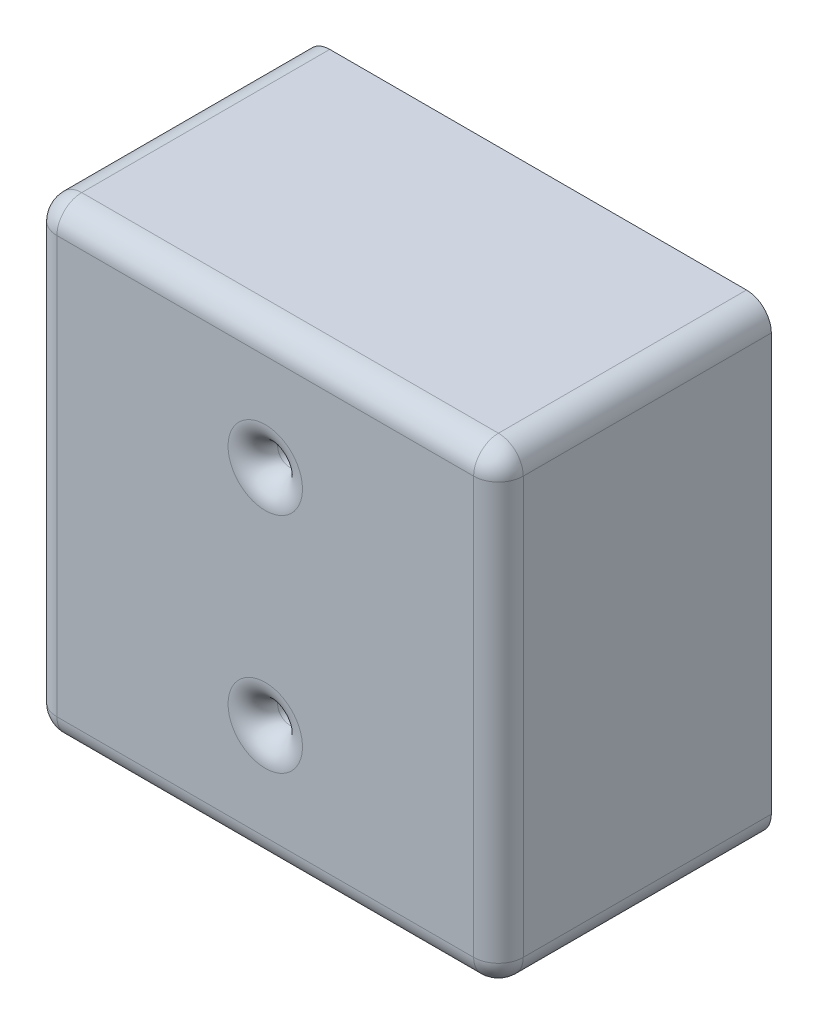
ISO-10303-21;
HEADER;
FILE_DESCRIPTION(('STEP AP214'),'2;1');
FILE_NAME('part.step','',(''),(''),'','','');
FILE_SCHEMA(('AUTOMOTIVE_DESIGN { 1 0 10303 214 1 1 1 1 }'));
ENDSEC;
DATA;
#1=APPLICATION_CONTEXT('core data for automotive mechanical design processes');
#2=APPLICATION_PROTOCOL_DEFINITION('international standard','automotive_design',2000,#1);
#3=PRODUCT_CONTEXT('',#1,'mechanical');
#4=PRODUCT('Part','Part','',(#3));
#5=PRODUCT_RELATED_PRODUCT_CATEGORY('part','',(#4));
#6=PRODUCT_DEFINITION_FORMATION('','',#4);
#7=PRODUCT_DEFINITION_CONTEXT('part definition',#1,'design');
#8=PRODUCT_DEFINITION('design','',#6,#7);
#9=PRODUCT_DEFINITION_SHAPE('','',#8);
#10=(LENGTH_UNIT() NAMED_UNIT(*) SI_UNIT(.MILLI.,.METRE.));
#11=(NAMED_UNIT(*) PLANE_ANGLE_UNIT() SI_UNIT($,.RADIAN.));
#12=(NAMED_UNIT(*) SI_UNIT($,.STERADIAN.) SOLID_ANGLE_UNIT());
#13=UNCERTAINTY_MEASURE_WITH_UNIT(LENGTH_MEASURE(1.E-05),#10,'distance_accuracy_value','');
#14=(GEOMETRIC_REPRESENTATION_CONTEXT(3) GLOBAL_UNCERTAINTY_ASSIGNED_CONTEXT((#13)) GLOBAL_UNIT_ASSIGNED_CONTEXT((#10,
#11,#12)) REPRESENTATION_CONTEXT('',''));
#15=CARTESIAN_POINT('',(0.,0.,0.));
#16=DIRECTION('',(0.,0.,1.));
#17=DIRECTION('',(1.,0.,0.));
#18=AXIS2_PLACEMENT_3D('',#15,#16,#17);
#19=CARTESIAN_POINT('',(-42.,42.,55.));
#20=DIRECTION('',(0.,0.,-1.));
#21=DIRECTION('',(-1.,0.,0.));
#22=AXIS2_PLACEMENT_3D('',#19,#20,#21);
#23=CYLINDRICAL_SURFACE('',#22,5.);
#24=DIRECTION('',(0.,0.,-1.));
#25=VECTOR('',#24,1.);
#26=CARTESIAN_POINT('',(-47.,42.,55.));
#27=LINE('',#26,#25);
#28=CARTESIAN_POINT('',(-47.,42.,50.));
#29=VERTEX_POINT('',#28);
#30=CARTESIAN_POINT('',(-47.,42.,0.));
#31=VERTEX_POINT('',#30);
#32=EDGE_CURVE('E105',#29,#31,#27,.T.);
#33=ORIENTED_EDGE('',*,*,#32,.F.);
#34=CARTESIAN_POINT('',(-42.,42.,50.));
#35=DIRECTION('',(0.,0.,-1.));
#36=DIRECTION('',(-1.,0.,0.));
#37=AXIS2_PLACEMENT_3D('',#34,#35,#36);
#38=CIRCLE('',#37,5.);
#39=CARTESIAN_POINT('',(-42.,47.,50.));
#40=VERTEX_POINT('',#39);
#41=EDGE_CURVE('E189',#29,#40,#38,.T.);
#42=ORIENTED_EDGE('',*,*,#41,.T.);
#43=DIRECTION('',(0.,0.,-1.));
#44=VECTOR('',#43,1.);
#45=CARTESIAN_POINT('',(-42.,47.,55.));
#46=LINE('',#45,#44);
#47=CARTESIAN_POINT('',(-42.,47.,0.));
#48=VERTEX_POINT('',#47);
#49=EDGE_CURVE('E126',#40,#48,#46,.T.);
#50=ORIENTED_EDGE('',*,*,#49,.T.);
#51=CARTESIAN_POINT('',(-42.,42.,0.));
#52=DIRECTION('',(0.,0.,1.));
#53=DIRECTION('',(-1.,0.,0.));
#54=AXIS2_PLACEMENT_3D('',#51,#52,#53);
#55=CIRCLE('',#54,5.);
#56=EDGE_CURVE('E120',#48,#31,#55,.T.);
#57=ORIENTED_EDGE('',*,*,#56,.T.);
#58=EDGE_LOOP('',(#33,#42,#50,#57));
#59=FACE_BOUND('',#58,.T.);
#60=ADVANCED_FACE('F30',(#59),#23,.T.);
#61=CARTESIAN_POINT('',(-47.,42.,55.));
#62=DIRECTION('',(1.,0.,0.));
#63=DIRECTION('',(0.,1.,0.));
#64=AXIS2_PLACEMENT_3D('',#61,#62,#63);
#65=PLANE('',#64);
#66=DIRECTION('',(0.,0.,-1.));
#67=VECTOR('',#66,1.);
#68=CARTESIAN_POINT('',(-47.,-42.,55.));
#69=LINE('',#68,#67);
#70=CARTESIAN_POINT('',(-47.,-42.,50.));
#71=VERTEX_POINT('',#70);
#72=CARTESIAN_POINT('',(-47.,-42.,0.));
#73=VERTEX_POINT('',#72);
#74=EDGE_CURVE('E114',#71,#73,#69,.T.);
#75=ORIENTED_EDGE('',*,*,#74,.F.);
#76=DIRECTION('',(0.,-1.,0.));
#77=VECTOR('',#76,1.);
#78=CARTESIAN_POINT('',(-47.,42.,50.));
#79=LINE('',#78,#77);
#80=EDGE_CURVE('E44',#71,#29,#79,.F.);
#81=ORIENTED_EDGE('',*,*,#80,.T.);
#82=ORIENTED_EDGE('',*,*,#32,.T.);
#83=DIRECTION('',(0.,-1.,0.));
#84=VECTOR('',#83,1.);
#85=CARTESIAN_POINT('',(-47.,42.,0.));
#86=LINE('',#85,#84);
#87=EDGE_CURVE('E108',#31,#73,#86,.T.);
#88=ORIENTED_EDGE('',*,*,#87,.T.);
#89=EDGE_LOOP('',(#75,#81,#82,#88));
#90=FACE_BOUND('',#89,.T.);
#91=ADVANCED_FACE('F107',(#90),#65,.F.);
#92=CARTESIAN_POINT('',(-42.,-42.,55.));
#93=DIRECTION('',(0.,0.,-1.));
#94=DIRECTION('',(-1.,0.,0.));
#95=AXIS2_PLACEMENT_3D('',#92,#93,#94);
#96=CYLINDRICAL_SURFACE('',#95,5.);
#97=DIRECTION('',(0.,0.,-1.));
#98=VECTOR('',#97,1.);
#99=CARTESIAN_POINT('',(-42.,-47.,55.));
#100=LINE('',#99,#98);
#101=CARTESIAN_POINT('',(-42.,-47.,50.));
#102=VERTEX_POINT('',#101);
#103=CARTESIAN_POINT('',(-42.,-47.,0.));
#104=VERTEX_POINT('',#103);
#105=EDGE_CURVE('E159',#102,#104,#100,.T.);
#106=ORIENTED_EDGE('',*,*,#105,.F.);
#107=CARTESIAN_POINT('',(-42.,-42.,50.));
#108=DIRECTION('',(0.,0.,-1.));
#109=DIRECTION('',(-1.,0.,0.));
#110=AXIS2_PLACEMENT_3D('',#107,#108,#109);
#111=CIRCLE('',#110,5.);
#112=EDGE_CURVE('E52',#102,#71,#111,.T.);
#113=ORIENTED_EDGE('',*,*,#112,.T.);
#114=ORIENTED_EDGE('',*,*,#74,.T.);
#115=CARTESIAN_POINT('',(-42.,-42.,0.));
#116=DIRECTION('',(0.,0.,1.));
#117=DIRECTION('',(1.,0.,0.));
#118=AXIS2_PLACEMENT_3D('',#115,#116,#117);
#119=CIRCLE('',#118,5.);
#120=EDGE_CURVE('E123',#73,#104,#119,.T.);
#121=ORIENTED_EDGE('',*,*,#120,.T.);
#122=EDGE_LOOP('',(#106,#113,#114,#121));
#123=FACE_BOUND('',#122,.T.);
#124=ADVANCED_FACE('F216',(#123),#96,.T.);
#125=CARTESIAN_POINT('',(-42.,-47.,55.));
#126=DIRECTION('',(0.,1.,0.));
#127=DIRECTION('',(-1.,0.,0.));
#128=AXIS2_PLACEMENT_3D('',#125,#126,#127);
#129=PLANE('',#128);
#130=DIRECTION('',(0.,0.,-1.));
#131=VECTOR('',#130,1.);
#132=CARTESIAN_POINT('',(42.,-47.,55.));
#133=LINE('',#132,#131);
#134=CARTESIAN_POINT('',(42.,-47.,50.));
#135=VERTEX_POINT('',#134);
#136=CARTESIAN_POINT('',(42.,-47.,0.));
#137=VERTEX_POINT('',#136);
#138=EDGE_CURVE('E157',#135,#137,#133,.T.);
#139=ORIENTED_EDGE('',*,*,#138,.F.);
#140=DIRECTION('',(1.,0.,0.));
#141=VECTOR('',#140,1.);
#142=CARTESIAN_POINT('',(-42.,-47.,50.));
#143=LINE('',#142,#141);
#144=EDGE_CURVE('E185',#135,#102,#143,.F.);
#145=ORIENTED_EDGE('',*,*,#144,.T.);
#146=ORIENTED_EDGE('',*,*,#105,.T.);
#147=DIRECTION('',(1.,0.,0.));
#148=VECTOR('',#147,1.);
#149=CARTESIAN_POINT('',(-42.,-47.,0.));
#150=LINE('',#149,#148);
#151=EDGE_CURVE('E136',#104,#137,#150,.T.);
#152=ORIENTED_EDGE('',*,*,#151,.T.);
#153=EDGE_LOOP('',(#139,#145,#146,#152));
#154=FACE_BOUND('',#153,.T.);
#155=ADVANCED_FACE('F220',(#154),#129,.F.);
#156=CARTESIAN_POINT('',(42.,-42.,55.));
#157=DIRECTION('',(0.,0.,-1.));
#158=DIRECTION('',(-1.,0.,0.));
#159=AXIS2_PLACEMENT_3D('',#156,#157,#158);
#160=CYLINDRICAL_SURFACE('',#159,4.99999999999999);
#161=DIRECTION('',(0.,0.,-1.));
#162=VECTOR('',#161,1.);
#163=CARTESIAN_POINT('',(47.,-42.,55.));
#164=LINE('',#163,#162);
#165=CARTESIAN_POINT('',(47.,-42.,50.));
#166=VERTEX_POINT('',#165);
#167=CARTESIAN_POINT('',(47.,-42.,0.));
#168=VERTEX_POINT('',#167);
#169=EDGE_CURVE('E155',#166,#168,#164,.T.);
#170=ORIENTED_EDGE('',*,*,#169,.F.);
#171=CARTESIAN_POINT('',(42.,-42.,50.));
#172=DIRECTION('',(0.,0.,-1.));
#173=DIRECTION('',(-1.,0.,0.));
#174=AXIS2_PLACEMENT_3D('',#171,#172,#173);
#175=CIRCLE('',#174,4.99999999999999);
#176=EDGE_CURVE('E183',#166,#135,#175,.T.);
#177=ORIENTED_EDGE('',*,*,#176,.T.);
#178=ORIENTED_EDGE('',*,*,#138,.T.);
#179=CARTESIAN_POINT('',(42.,-42.,0.));
#180=DIRECTION('',(0.,0.,1.));
#181=DIRECTION('',(1.,0.,0.));
#182=AXIS2_PLACEMENT_3D('',#179,#180,#181);
#183=CIRCLE('',#182,4.99999999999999);
#184=EDGE_CURVE('E139',#137,#168,#183,.T.);
#185=ORIENTED_EDGE('',*,*,#184,.T.);
#186=EDGE_LOOP('',(#170,#177,#178,#185));
#187=FACE_BOUND('',#186,.T.);
#188=ADVANCED_FACE('F225',(#187),#160,.T.);
#189=CARTESIAN_POINT('',(47.,42.,55.));
#190=DIRECTION('',(-1.,0.,0.));
#191=DIRECTION('',(0.,-1.,0.));
#192=AXIS2_PLACEMENT_3D('',#189,#190,#191);
#193=PLANE('',#192);
#194=DIRECTION('',(0.,0.,-1.));
#195=VECTOR('',#194,1.);
#196=CARTESIAN_POINT('',(47.,42.,55.));
#197=LINE('',#196,#195);
#198=CARTESIAN_POINT('',(47.,42.,50.));
#199=VERTEX_POINT('',#198);
#200=CARTESIAN_POINT('',(47.,42.,0.));
#201=VERTEX_POINT('',#200);
#202=EDGE_CURVE('E153',#199,#201,#197,.T.);
#203=ORIENTED_EDGE('',*,*,#202,.F.);
#204=DIRECTION('',(0.,1.,0.));
#205=VECTOR('',#204,1.);
#206=CARTESIAN_POINT('',(47.,42.,50.));
#207=LINE('',#206,#205);
#208=EDGE_CURVE('E181',#199,#166,#207,.F.);
#209=ORIENTED_EDGE('',*,*,#208,.T.);
#210=ORIENTED_EDGE('',*,*,#169,.T.);
#211=DIRECTION('',(0.,1.,0.));
#212=VECTOR('',#211,1.);
#213=CARTESIAN_POINT('',(47.,42.,0.));
#214=LINE('',#213,#212);
#215=EDGE_CURVE('E142',#168,#201,#214,.T.);
#216=ORIENTED_EDGE('',*,*,#215,.T.);
#217=EDGE_LOOP('',(#203,#209,#210,#216));
#218=FACE_BOUND('',#217,.T.);
#219=ADVANCED_FACE('F229',(#218),#193,.F.);
#220=CARTESIAN_POINT('',(42.,42.,55.));
#221=DIRECTION('',(0.,0.,-1.));
#222=DIRECTION('',(-1.,0.,0.));
#223=AXIS2_PLACEMENT_3D('',#220,#221,#222);
#224=CYLINDRICAL_SURFACE('',#223,4.99999999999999);
#225=DIRECTION('',(0.,0.,-1.));
#226=VECTOR('',#225,1.);
#227=CARTESIAN_POINT('',(42.,47.,55.));
#228=LINE('',#227,#226);
#229=CARTESIAN_POINT('',(42.,47.,50.));
#230=VERTEX_POINT('',#229);
#231=CARTESIAN_POINT('',(42.,47.,0.));
#232=VERTEX_POINT('',#231);
#233=EDGE_CURVE('E151',#230,#232,#228,.T.);
#234=ORIENTED_EDGE('',*,*,#233,.F.);
#235=CARTESIAN_POINT('',(42.,42.,50.));
#236=DIRECTION('',(0.,0.,-1.));
#237=DIRECTION('',(-1.,0.,0.));
#238=AXIS2_PLACEMENT_3D('',#235,#236,#237);
#239=CIRCLE('',#238,4.99999999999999);
#240=EDGE_CURVE('E179',#230,#199,#239,.T.);
#241=ORIENTED_EDGE('',*,*,#240,.T.);
#242=ORIENTED_EDGE('',*,*,#202,.T.);
#243=CARTESIAN_POINT('',(42.,42.,0.));
#244=DIRECTION('',(0.,0.,1.));
#245=DIRECTION('',(1.,0.,0.));
#246=AXIS2_PLACEMENT_3D('',#243,#244,#245);
#247=CIRCLE('',#246,4.99999999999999);
#248=EDGE_CURVE('E145',#201,#232,#247,.T.);
#249=ORIENTED_EDGE('',*,*,#248,.T.);
#250=EDGE_LOOP('',(#234,#241,#242,#249));
#251=FACE_BOUND('',#250,.T.);
#252=ADVANCED_FACE('F233',(#251),#224,.T.);
#253=CARTESIAN_POINT('',(-42.,47.,55.));
#254=DIRECTION('',(0.,-1.,0.));
#255=DIRECTION('',(1.,0.,0.));
#256=AXIS2_PLACEMENT_3D('',#253,#254,#255);
#257=PLANE('',#256);
#258=ORIENTED_EDGE('',*,*,#49,.F.);
#259=DIRECTION('',(-1.,0.,0.));
#260=VECTOR('',#259,1.);
#261=CARTESIAN_POINT('',(-42.,47.,50.));
#262=LINE('',#261,#260);
#263=EDGE_CURVE('E176',#40,#230,#262,.F.);
#264=ORIENTED_EDGE('',*,*,#263,.T.);
#265=ORIENTED_EDGE('',*,*,#233,.T.);
#266=DIRECTION('',(-1.,0.,0.));
#267=VECTOR('',#266,1.);
#268=CARTESIAN_POINT('',(-42.,47.,0.));
#269=LINE('',#268,#267);
#270=EDGE_CURVE('E148',#232,#48,#269,.T.);
#271=ORIENTED_EDGE('',*,*,#270,.T.);
#272=EDGE_LOOP('',(#258,#264,#265,#271));
#273=FACE_BOUND('',#272,.T.);
#274=ADVANCED_FACE('F237',(#273),#257,.F.);
#275=CARTESIAN_POINT('',(-42.,42.,55.));
#276=DIRECTION('',(0.,0.,-1.));
#277=DIRECTION('',(-1.,0.,0.));
#278=AXIS2_PLACEMENT_3D('',#275,#276,#277);
#279=PLANE('',#278);
#280=DIRECTION('',(0.,1.,0.));
#281=VECTOR('',#280,1.);
#282=CARTESIAN_POINT('',(42.,42.,55.));
#283=LINE('',#282,#281);
#284=CARTESIAN_POINT('',(42.,-42.,55.));
#285=VERTEX_POINT('',#284);
#286=CARTESIAN_POINT('',(42.,42.,55.));
#287=VERTEX_POINT('',#286);
#288=EDGE_CURVE('E171',#285,#287,#283,.T.);
#289=ORIENTED_EDGE('',*,*,#288,.T.);
#290=DIRECTION('',(-1.,0.,0.));
#291=VECTOR('',#290,1.);
#292=CARTESIAN_POINT('',(-42.,42.,55.));
#293=LINE('',#292,#291);
#294=CARTESIAN_POINT('',(-42.,42.,55.));
#295=VERTEX_POINT('',#294);
#296=EDGE_CURVE('E173',#287,#295,#293,.T.);
#297=ORIENTED_EDGE('',*,*,#296,.T.);
#298=DIRECTION('',(0.,-1.,0.));
#299=VECTOR('',#298,1.);
#300=CARTESIAN_POINT('',(-42.,42.,55.));
#301=LINE('',#300,#299);
#302=CARTESIAN_POINT('',(-42.,-42.,55.));
#303=VERTEX_POINT('',#302);
#304=EDGE_CURVE('E167',#295,#303,#301,.T.);
#305=ORIENTED_EDGE('',*,*,#304,.T.);
#306=DIRECTION('',(1.,0.,0.));
#307=VECTOR('',#306,1.);
#308=CARTESIAN_POINT('',(-42.,-42.,55.));
#309=LINE('',#308,#307);
#310=EDGE_CURVE('E169',#303,#285,#309,.T.);
#311=ORIENTED_EDGE('',*,*,#310,.T.);
#312=EDGE_LOOP('',(#289,#297,#305,#311));
#313=FACE_BOUND('',#312,.T.);
#314=CARTESIAN_POINT('',(0.,22.5,55.));
#315=DIRECTION('',(0.,0.,-1.));
#316=DIRECTION('',(-1.,0.,0.));
#317=AXIS2_PLACEMENT_3D('',#314,#315,#316);
#318=CIRCLE('',#317,7.5);
#319=CARTESIAN_POINT('',(-7.5,22.5,55.));
#320=VERTEX_POINT('',#319);
#321=EDGE_CURVE('E164',#320,#320,#318,.T.);
#322=ORIENTED_EDGE('',*,*,#321,.T.);
#323=EDGE_LOOP('',(#322));
#324=FACE_BOUND('',#323,.T.);
#325=CARTESIAN_POINT('',(0.,-22.5,55.));
#326=DIRECTION('',(0.,0.,-1.));
#327=DIRECTION('',(-1.,0.,0.));
#328=AXIS2_PLACEMENT_3D('',#325,#326,#327);
#329=CIRCLE('',#328,7.5);
#330=CARTESIAN_POINT('',(-7.5,-22.5,55.));
#331=VERTEX_POINT('',#330);
#332=EDGE_CURVE('E113',#331,#331,#329,.T.);
#333=ORIENTED_EDGE('',*,*,#332,.T.);
#334=EDGE_LOOP('',(#333));
#335=FACE_BOUND('',#334,.T.);
#336=ADVANCED_FACE('F241',(#313,#324,#335),#279,.F.);
#337=CARTESIAN_POINT('',(-42.,42.,0.));
#338=DIRECTION('',(0.,0.,-1.));
#339=DIRECTION('',(-1.,0.,0.));
#340=AXIS2_PLACEMENT_3D('',#337,#338,#339);
#341=PLANE('',#340);
#342=CARTESIAN_POINT('',(0.,-25.,0.));
#343=DIRECTION('',(0.,0.,-1.));
#344=DIRECTION('',(-1.,0.,0.));
#345=AXIS2_PLACEMENT_3D('',#342,#343,#344);
#346=CIRCLE('',#345,3.);
#347=CARTESIAN_POINT('',(-3.,-25.,0.));
#348=VERTEX_POINT('',#347);
#349=EDGE_CURVE('E351',#348,#348,#346,.T.);
#350=ORIENTED_EDGE('',*,*,#349,.F.);
#351=EDGE_LOOP('',(#350));
#352=FACE_BOUND('',#351,.T.);
#353=CARTESIAN_POINT('',(0.,25.,0.));
#354=DIRECTION('',(0.,0.,-1.));
#355=DIRECTION('',(-1.,0.,0.));
#356=AXIS2_PLACEMENT_3D('',#353,#354,#355);
#357=CIRCLE('',#356,3.);
#358=CARTESIAN_POINT('',(-3.,25.,0.));
#359=VERTEX_POINT('',#358);
#360=EDGE_CURVE('E131',#359,#359,#357,.T.);
#361=ORIENTED_EDGE('',*,*,#360,.F.);
#362=EDGE_LOOP('',(#361));
#363=FACE_BOUND('',#362,.T.);
#364=ORIENTED_EDGE('',*,*,#56,.F.);
#365=ORIENTED_EDGE('',*,*,#270,.F.);
#366=ORIENTED_EDGE('',*,*,#248,.F.);
#367=ORIENTED_EDGE('',*,*,#215,.F.);
#368=ORIENTED_EDGE('',*,*,#184,.F.);
#369=ORIENTED_EDGE('',*,*,#151,.F.);
#370=ORIENTED_EDGE('',*,*,#120,.F.);
#371=ORIENTED_EDGE('',*,*,#87,.F.);
#372=EDGE_LOOP('',(#364,#365,#366,#367,#368,#369,#370,#371));
#373=FACE_BOUND('',#372,.T.);
#374=ADVANCED_FACE('F118',(#352,#363,#373),#341,.T.);
#375=CARTESIAN_POINT('',(0.,25.,20.));
#376=DIRECTION('',(0.,0.,-1.));
#377=DIRECTION('',(-1.,0.,0.));
#378=AXIS2_PLACEMENT_3D('',#375,#376,#377);
#379=CYLINDRICAL_SURFACE('',#378,3.);
#380=CARTESIAN_POINT('',(0.,25.,20.));
#381=DIRECTION('',(0.,0.,-1.));
#382=DIRECTION('',(-1.,0.,0.));
#383=AXIS2_PLACEMENT_3D('',#380,#381,#382);
#384=CIRCLE('',#383,3.);
#385=CARTESIAN_POINT('',(-3.,25.,20.));
#386=VERTEX_POINT('',#385);
#387=EDGE_CURVE('E128',#386,#386,#384,.T.);
#388=ORIENTED_EDGE('',*,*,#387,.F.);
#389=EDGE_LOOP('',(#388));
#390=FACE_BOUND('',#389,.T.);
#391=ORIENTED_EDGE('',*,*,#360,.T.);
#392=EDGE_LOOP('',(#391));
#393=FACE_BOUND('',#392,.T.);
#394=ADVANCED_FACE('F248',(#390,#393),#379,.F.);
#395=CARTESIAN_POINT('',(0.,25.,20.));
#396=DIRECTION('',(0.,0.,-1.));
#397=DIRECTION('',(-1.,0.,0.));
#398=AXIS2_PLACEMENT_3D('',#395,#396,#397);
#399=PLANE('',#398);
#400=ORIENTED_EDGE('',*,*,#387,.T.);
#401=EDGE_LOOP('',(#400));
#402=FACE_BOUND('',#401,.T.);
#403=ADVANCED_FACE('F252',(#402),#399,.T.);
#404=CARTESIAN_POINT('',(0.,-25.,20.));
#405=DIRECTION('',(0.,0.,-1.));
#406=DIRECTION('',(-1.,0.,0.));
#407=AXIS2_PLACEMENT_3D('',#404,#405,#406);
#408=CYLINDRICAL_SURFACE('',#407,3.);
#409=CARTESIAN_POINT('',(0.,-25.,20.));
#410=DIRECTION('',(0.,0.,-1.));
#411=DIRECTION('',(-1.,0.,0.));
#412=AXIS2_PLACEMENT_3D('',#409,#410,#411);
#413=CIRCLE('',#412,3.);
#414=CARTESIAN_POINT('',(-3.,-25.,20.));
#415=VERTEX_POINT('',#414);
#416=EDGE_CURVE('E354',#415,#415,#413,.T.);
#417=ORIENTED_EDGE('',*,*,#416,.F.);
#418=EDGE_LOOP('',(#417));
#419=FACE_BOUND('',#418,.T.);
#420=ORIENTED_EDGE('',*,*,#349,.T.);
#421=EDGE_LOOP('',(#420));
#422=FACE_BOUND('',#421,.T.);
#423=ADVANCED_FACE('F256',(#419,#422),#408,.F.);
#424=CARTESIAN_POINT('',(0.,-25.,20.));
#425=DIRECTION('',(0.,0.,-1.));
#426=DIRECTION('',(-1.,0.,0.));
#427=AXIS2_PLACEMENT_3D('',#424,#425,#426);
#428=PLANE('',#427);
#429=ORIENTED_EDGE('',*,*,#416,.T.);
#430=EDGE_LOOP('',(#429));
#431=FACE_BOUND('',#430,.T.);
#432=ADVANCED_FACE('F260',(#431),#428,.T.);
#433=CARTESIAN_POINT('',(0.,22.5,35.));
#434=DIRECTION('',(0.,0.,1.));
#435=DIRECTION('',(1.,0.,0.));
#436=AXIS2_PLACEMENT_3D('',#433,#434,#435);
#437=CYLINDRICAL_SURFACE('',#436,2.5);
#438=CARTESIAN_POINT('',(0.,22.5,50.));
#439=DIRECTION('',(0.,0.,-1.));
#440=DIRECTION('',(-1.,0.,0.));
#441=AXIS2_PLACEMENT_3D('',#438,#439,#440);
#442=CIRCLE('',#441,2.5);
#443=CARTESIAN_POINT('',(-2.5,22.5,50.));
#444=VERTEX_POINT('',#443);
#445=EDGE_CURVE('E37',#444,#444,#442,.F.);
#446=ORIENTED_EDGE('',*,*,#445,.T.);
#447=EDGE_LOOP('',(#446));
#448=FACE_BOUND('',#447,.T.);
#449=CARTESIAN_POINT('',(0.,22.5,35.));
#450=DIRECTION('',(0.,0.,1.));
#451=DIRECTION('',(1.,0.,0.));
#452=AXIS2_PLACEMENT_3D('',#449,#450,#451);
#453=CIRCLE('',#452,2.5);
#454=CARTESIAN_POINT('',(2.5,22.5,35.));
#455=VERTEX_POINT('',#454);
#456=EDGE_CURVE('E348',#455,#455,#453,.T.);
#457=ORIENTED_EDGE('',*,*,#456,.F.);
#458=EDGE_LOOP('',(#457));
#459=FACE_BOUND('',#458,.T.);
#460=ADVANCED_FACE('F193',(#448,#459),#437,.F.);
#461=CARTESIAN_POINT('',(0.,22.5,35.));
#462=DIRECTION('',(0.,0.,1.));
#463=DIRECTION('',(1.,0.,0.));
#464=AXIS2_PLACEMENT_3D('',#461,#462,#463);
#465=PLANE('',#464);
#466=ORIENTED_EDGE('',*,*,#456,.T.);
#467=EDGE_LOOP('',(#466));
#468=FACE_BOUND('',#467,.T.);
#469=ADVANCED_FACE('F267',(#468),#465,.T.);
#470=CARTESIAN_POINT('',(0.,-22.5,35.));
#471=DIRECTION('',(0.,0.,1.));
#472=DIRECTION('',(1.,0.,0.));
#473=AXIS2_PLACEMENT_3D('',#470,#471,#472);
#474=CYLINDRICAL_SURFACE('',#473,2.5);
#475=CARTESIAN_POINT('',(0.,-22.5,50.));
#476=DIRECTION('',(0.,0.,-1.));
#477=DIRECTION('',(-1.,0.,0.));
#478=AXIS2_PLACEMENT_3D('',#475,#476,#477);
#479=CIRCLE('',#478,2.5);
#480=CARTESIAN_POINT('',(-2.5,-22.5,50.));
#481=VERTEX_POINT('',#480);
#482=EDGE_CURVE('E11',#481,#481,#479,.F.);
#483=ORIENTED_EDGE('',*,*,#482,.T.);
#484=EDGE_LOOP('',(#483));
#485=FACE_BOUND('',#484,.T.);
#486=CARTESIAN_POINT('',(0.,-22.5,35.));
#487=DIRECTION('',(0.,0.,1.));
#488=DIRECTION('',(1.,0.,0.));
#489=AXIS2_PLACEMENT_3D('',#486,#487,#488);
#490=CIRCLE('',#489,2.5);
#491=CARTESIAN_POINT('',(2.5,-22.5,35.));
#492=VERTEX_POINT('',#491);
#493=EDGE_CURVE('E345',#492,#492,#490,.T.);
#494=ORIENTED_EDGE('',*,*,#493,.F.);
#495=EDGE_LOOP('',(#494));
#496=FACE_BOUND('',#495,.T.);
#497=ADVANCED_FACE('F270',(#485,#496),#474,.F.);
#498=CARTESIAN_POINT('',(0.,-22.5,35.));
#499=DIRECTION('',(0.,0.,1.));
#500=DIRECTION('',(1.,0.,0.));
#501=AXIS2_PLACEMENT_3D('',#498,#499,#500);
#502=PLANE('',#501);
#503=ORIENTED_EDGE('',*,*,#493,.T.);
#504=EDGE_LOOP('',(#503));
#505=FACE_BOUND('',#504,.T.);
#506=ADVANCED_FACE('F274',(#505),#502,.T.);
#507=CARTESIAN_POINT('',(-42.,-42.,50.));
#508=DIRECTION('',(1.,0.,0.));
#509=DIRECTION('',(0.,1.,0.));
#510=AXIS2_PLACEMENT_3D('',#507,#508,#509);
#511=CYLINDRICAL_SURFACE('',#510,5.);
#512=CARTESIAN_POINT('',(-42.,-42.,50.));
#513=DIRECTION('',(-1.,0.,0.));
#514=DIRECTION('',(0.,0.,1.));
#515=AXIS2_PLACEMENT_3D('',#512,#513,#514);
#516=CIRCLE('',#515,5.);
#517=EDGE_CURVE('E334',#102,#303,#516,.T.);
#518=ORIENTED_EDGE('',*,*,#517,.F.);
#519=ORIENTED_EDGE('',*,*,#144,.F.);
#520=CARTESIAN_POINT('',(42.,-42.,50.));
#521=DIRECTION('',(1.,0.,0.));
#522=DIRECTION('',(0.,0.,-1.));
#523=AXIS2_PLACEMENT_3D('',#520,#521,#522);
#524=CIRCLE('',#523,5.);
#525=EDGE_CURVE('E338',#285,#135,#524,.T.);
#526=ORIENTED_EDGE('',*,*,#525,.F.);
#527=ORIENTED_EDGE('',*,*,#310,.F.);
#528=EDGE_LOOP('',(#518,#519,#526,#527));
#529=FACE_BOUND('',#528,.T.);
#530=ADVANCED_FACE('F278',(#529),#511,.T.);
#531=CARTESIAN_POINT('',(42.,-42.,50.));
#532=DIRECTION('',(0.,0.,1.));
#533=DIRECTION('',(1.,0.,0.));
#534=AXIS2_PLACEMENT_3D('',#531,#532,#533);
#535=SPHERICAL_SURFACE('',#534,5.);
#536=ORIENTED_EDGE('',*,*,#525,.T.);
#537=ORIENTED_EDGE('',*,*,#176,.F.);
#538=CARTESIAN_POINT('',(42.,-42.,50.));
#539=DIRECTION('',(0.,1.,0.));
#540=DIRECTION('',(0.,0.,1.));
#541=AXIS2_PLACEMENT_3D('',#538,#539,#540);
#542=CIRCLE('',#541,5.);
#543=EDGE_CURVE('E331',#285,#166,#542,.T.);
#544=ORIENTED_EDGE('',*,*,#543,.F.);
#545=EDGE_LOOP('',(#536,#537,#544));
#546=FACE_BOUND('',#545,.T.);
#547=ADVANCED_FACE('F282',(#546),#535,.T.);
#548=CARTESIAN_POINT('',(-42.,-42.,50.));
#549=DIRECTION('',(0.,0.,1.));
#550=DIRECTION('',(1.,0.,0.));
#551=AXIS2_PLACEMENT_3D('',#548,#549,#550);
#552=SPHERICAL_SURFACE('',#551,5.);
#553=ORIENTED_EDGE('',*,*,#112,.F.);
#554=ORIENTED_EDGE('',*,*,#517,.T.);
#555=CARTESIAN_POINT('',(-42.,-42.,50.));
#556=DIRECTION('',(0.,1.,0.));
#557=DIRECTION('',(0.,0.,1.));
#558=AXIS2_PLACEMENT_3D('',#555,#556,#557);
#559=CIRCLE('',#558,5.);
#560=EDGE_CURVE('E335',#71,#303,#559,.T.);
#561=ORIENTED_EDGE('',*,*,#560,.F.);
#562=EDGE_LOOP('',(#553,#554,#561));
#563=FACE_BOUND('',#562,.T.);
#564=ADVANCED_FACE('F286',(#563),#552,.T.);
#565=CARTESIAN_POINT('',(42.,42.,50.));
#566=DIRECTION('',(0.,1.,0.));
#567=DIRECTION('',(-1.,0.,0.));
#568=AXIS2_PLACEMENT_3D('',#565,#566,#567);
#569=CYLINDRICAL_SURFACE('',#568,5.);
#570=ORIENTED_EDGE('',*,*,#543,.T.);
#571=ORIENTED_EDGE('',*,*,#208,.F.);
#572=CARTESIAN_POINT('',(42.,42.,50.));
#573=DIRECTION('',(0.,1.,0.));
#574=DIRECTION('',(0.,0.,1.));
#575=AXIS2_PLACEMENT_3D('',#572,#573,#574);
#576=CIRCLE('',#575,5.);
#577=EDGE_CURVE('E322',#287,#199,#576,.T.);
#578=ORIENTED_EDGE('',*,*,#577,.F.);
#579=ORIENTED_EDGE('',*,*,#288,.F.);
#580=EDGE_LOOP('',(#570,#571,#578,#579));
#581=FACE_BOUND('',#580,.T.);
#582=ADVANCED_FACE('F290',(#581),#569,.T.);
#583=CARTESIAN_POINT('',(-42.,42.,50.));
#584=DIRECTION('',(0.,-1.,0.));
#585=DIRECTION('',(1.,0.,0.));
#586=AXIS2_PLACEMENT_3D('',#583,#584,#585);
#587=CYLINDRICAL_SURFACE('',#586,5.);
#588=ORIENTED_EDGE('',*,*,#560,.T.);
#589=ORIENTED_EDGE('',*,*,#304,.F.);
#590=CARTESIAN_POINT('',(-42.,42.,50.));
#591=DIRECTION('',(0.,1.,0.));
#592=DIRECTION('',(0.,0.,1.));
#593=AXIS2_PLACEMENT_3D('',#590,#591,#592);
#594=CIRCLE('',#593,5.);
#595=EDGE_CURVE('E310',#29,#295,#594,.T.);
#596=ORIENTED_EDGE('',*,*,#595,.F.);
#597=ORIENTED_EDGE('',*,*,#80,.F.);
#598=EDGE_LOOP('',(#588,#589,#596,#597));
#599=FACE_BOUND('',#598,.T.);
#600=ADVANCED_FACE('F294',(#599),#587,.T.);
#601=CARTESIAN_POINT('',(42.,42.,50.));
#602=DIRECTION('',(0.,0.,1.));
#603=DIRECTION('',(1.,0.,0.));
#604=AXIS2_PLACEMENT_3D('',#601,#602,#603);
#605=SPHERICAL_SURFACE('',#604,5.);
#606=ORIENTED_EDGE('',*,*,#577,.T.);
#607=ORIENTED_EDGE('',*,*,#240,.F.);
#608=CARTESIAN_POINT('',(42.,42.,50.));
#609=DIRECTION('',(-1.,0.,0.));
#610=DIRECTION('',(0.,0.,1.));
#611=AXIS2_PLACEMENT_3D('',#608,#609,#610);
#612=CIRCLE('',#611,5.);
#613=EDGE_CURVE('E317',#287,#230,#612,.T.);
#614=ORIENTED_EDGE('',*,*,#613,.F.);
#615=EDGE_LOOP('',(#606,#607,#614));
#616=FACE_BOUND('',#615,.T.);
#617=ADVANCED_FACE('F298',(#616),#605,.T.);
#618=CARTESIAN_POINT('',(-42.,42.,50.));
#619=DIRECTION('',(0.,0.,1.));
#620=DIRECTION('',(1.,0.,0.));
#621=AXIS2_PLACEMENT_3D('',#618,#619,#620);
#622=SPHERICAL_SURFACE('',#621,5.);
#623=ORIENTED_EDGE('',*,*,#41,.F.);
#624=ORIENTED_EDGE('',*,*,#595,.T.);
#625=CARTESIAN_POINT('',(-42.,42.,50.));
#626=DIRECTION('',(1.,0.,0.));
#627=DIRECTION('',(0.,0.,-1.));
#628=AXIS2_PLACEMENT_3D('',#625,#626,#627);
#629=CIRCLE('',#628,5.);
#630=EDGE_CURVE('E312',#40,#295,#629,.T.);
#631=ORIENTED_EDGE('',*,*,#630,.F.);
#632=EDGE_LOOP('',(#623,#624,#631));
#633=FACE_BOUND('',#632,.T.);
#634=ADVANCED_FACE('F208',(#633),#622,.T.);
#635=CARTESIAN_POINT('',(-42.,42.,50.));
#636=DIRECTION('',(-1.,0.,0.));
#637=DIRECTION('',(0.,-1.,0.));
#638=AXIS2_PLACEMENT_3D('',#635,#636,#637);
#639=CYLINDRICAL_SURFACE('',#638,5.);
#640=ORIENTED_EDGE('',*,*,#613,.T.);
#641=ORIENTED_EDGE('',*,*,#263,.F.);
#642=ORIENTED_EDGE('',*,*,#630,.T.);
#643=ORIENTED_EDGE('',*,*,#296,.F.);
#644=EDGE_LOOP('',(#640,#641,#642,#643));
#645=FACE_BOUND('',#644,.T.);
#646=ADVANCED_FACE('F199',(#645),#639,.T.);
#647=CARTESIAN_POINT('',(0.,22.5,50.));
#648=DIRECTION('',(0.,0.,-1.));
#649=DIRECTION('',(-1.,0.,0.));
#650=AXIS2_PLACEMENT_3D('',#647,#648,#649);
#651=TOROIDAL_SURFACE('',#650,7.5,5.);
#652=ORIENTED_EDGE('',*,*,#321,.F.);
#653=EDGE_LOOP('',(#652));
#654=FACE_BOUND('',#653,.T.);
#655=ORIENTED_EDGE('',*,*,#445,.F.);
#656=EDGE_LOOP('',(#655));
#657=FACE_BOUND('',#656,.T.);
#658=ADVANCED_FACE('F196',(#654,#657),#651,.T.);
#659=CARTESIAN_POINT('',(0.,-22.5,50.));
#660=DIRECTION('',(0.,0.,-1.));
#661=DIRECTION('',(-1.,0.,0.));
#662=AXIS2_PLACEMENT_3D('',#659,#660,#661);
#663=TOROIDAL_SURFACE('',#662,7.5,5.);
#664=ORIENTED_EDGE('',*,*,#332,.F.);
#665=EDGE_LOOP('',(#664));
#666=FACE_BOUND('',#665,.T.);
#667=ORIENTED_EDGE('',*,*,#482,.F.);
#668=EDGE_LOOP('',(#667));
#669=FACE_BOUND('',#668,.T.);
#670=ADVANCED_FACE('F198',(#666,#669),#663,.T.);
#671=CLOSED_SHELL('',(#60,#91,#124,#155,#188,#219,#252,#274,#336,#374,#394,#403,#423,#432,#460,
#469,#497,#506,#530,#547,#564,#582,#600,#617,#634,#646,#658,#670));
#672=MANIFOLD_SOLID_BREP('B2',#671);
#673=ADVANCED_BREP_SHAPE_REPRESENTATION('',(#18,#672),#14);
#674=SHAPE_DEFINITION_REPRESENTATION(#9,#673);
ENDSEC;
END-ISO-10303-21;
